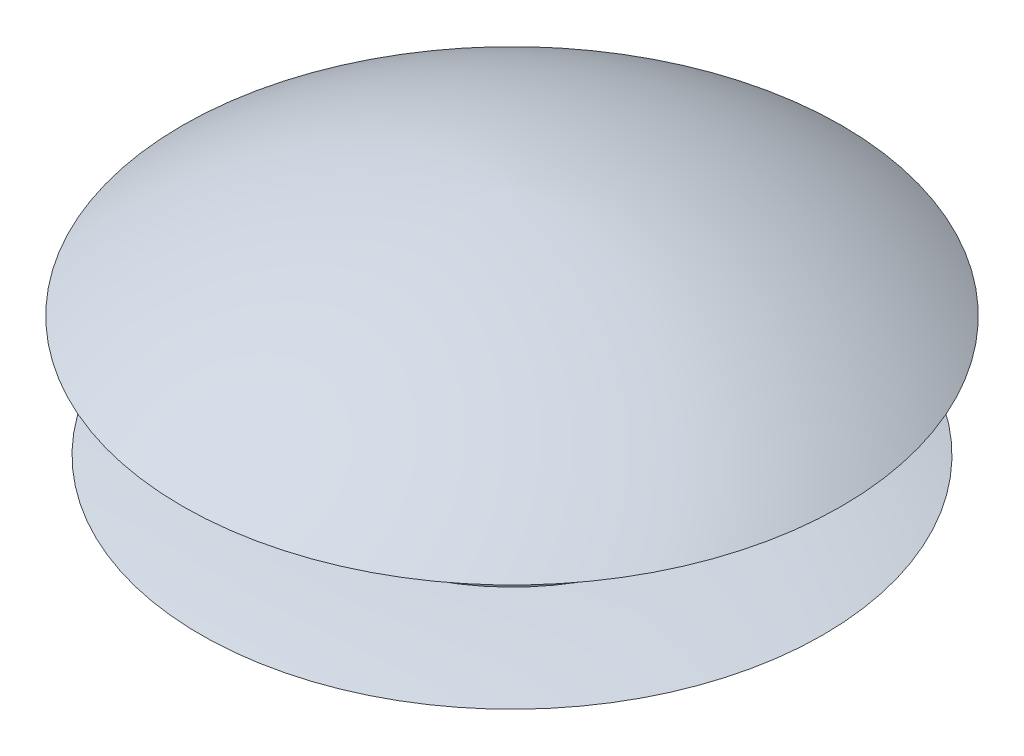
ISO-10303-21;
HEADER;
FILE_DESCRIPTION(('STEP AP214'),'2;1');
FILE_NAME('part.step','',(''),(''),'','','');
FILE_SCHEMA(('AUTOMOTIVE_DESIGN { 1 0 10303 214 1 1 1 1 }'));
ENDSEC;
DATA;
#1=APPLICATION_CONTEXT('core data for automotive mechanical design processes');
#2=APPLICATION_PROTOCOL_DEFINITION('international standard','automotive_design',2000,#1);
#3=PRODUCT_CONTEXT('',#1,'mechanical');
#4=PRODUCT('Part','Part','',(#3));
#5=PRODUCT_RELATED_PRODUCT_CATEGORY('part','',(#4));
#6=PRODUCT_DEFINITION_FORMATION('','',#4);
#7=PRODUCT_DEFINITION_CONTEXT('part definition',#1,'design');
#8=PRODUCT_DEFINITION('design','',#6,#7);
#9=PRODUCT_DEFINITION_SHAPE('','',#8);
#10=(LENGTH_UNIT() NAMED_UNIT(*) SI_UNIT(.MILLI.,.METRE.));
#11=(NAMED_UNIT(*) PLANE_ANGLE_UNIT() SI_UNIT($,.RADIAN.));
#12=(NAMED_UNIT(*) SI_UNIT($,.STERADIAN.) SOLID_ANGLE_UNIT());
#13=UNCERTAINTY_MEASURE_WITH_UNIT(LENGTH_MEASURE(1.E-05),#10,'distance_accuracy_value','');
#14=(GEOMETRIC_REPRESENTATION_CONTEXT(3) GLOBAL_UNCERTAINTY_ASSIGNED_CONTEXT((#13)) GLOBAL_UNIT_ASSIGNED_CONTEXT((#10,
#11,#12)) REPRESENTATION_CONTEXT('',''));
#15=CARTESIAN_POINT('',(0.,0.,0.));
#16=DIRECTION('',(0.,0.,1.));
#17=DIRECTION('',(1.,0.,0.));
#18=AXIS2_PLACEMENT_3D('',#15,#16,#17);
#19=CARTESIAN_POINT('',(0.,-16.4793605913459,0.625945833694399));
#20=DIRECTION('',(-1.,0.,0.));
#21=DIRECTION('',(0.,0.,-1.));
#22=AXIS2_PLACEMENT_3D('',#19,#20,#21);
#23=CIRCLE('',#22,15.3518062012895);
#24=TRIMMED_CURVE('',#23,(PARAMETER_VALUE(-1.53001158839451)),
(PARAMETER_VALUE(1.53001158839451)),.T.,.PARAMETER.);
#25=CARTESIAN_POINT('',(0.,-16.4793605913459,0.));
#26=DIRECTION('',(0.,-1.,0.));
#27=AXIS1_PLACEMENT('',#25,#26);
#28=SURFACE_OF_REVOLUTION('',#24,#27);
#29=CARTESIAN_POINT('',(0.,-1.14032067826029,0.));
#30=VERTEX_POINT('',#29);
#31=VERTEX_LOOP('',#30);
#32=FACE_BOUND('',#31,.T.);
#33=CARTESIAN_POINT('',(0.,-1.84110322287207,0.));
#34=DIRECTION('',(0.,-1.,0.));
#35=DIRECTION('',(1.,0.,0.));
#36=AXIS2_PLACEMENT_3D('',#33,#34,#35);
#37=CIRCLE('',#36,4.);
#38=CARTESIAN_POINT('',(4.,-1.84110322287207,0.));
#39=VERTEX_POINT('',#38);
#40=EDGE_CURVE('E35',#39,#39,#37,.T.);
#41=ORIENTED_EDGE('',*,*,#40,.T.);
#42=EDGE_LOOP('',(#41));
#43=FACE_BOUND('',#42,.T.);
#44=ADVANCED_FACE('F15',(#32,#43),#28,.F.);
#45=CARTESIAN_POINT('',(0.,-4.42055161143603,0.));
#46=DIRECTION('',(0.,-1.,0.));
#47=DIRECTION('',(1.,0.,0.));
#48=AXIS2_PLACEMENT_3D('',#45,#46,#47);
#49=CYLINDRICAL_SURFACE('',#48,4.);
#50=CARTESIAN_POINT('',(0.,-7.,0.));
#51=DIRECTION('',(0.,1.,0.));
#52=DIRECTION('',(-1.,0.,0.));
#53=AXIS2_PLACEMENT_3D('',#50,#51,#52);
#54=CIRCLE('',#53,4.);
#55=CARTESIAN_POINT('',(-3.99999999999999,-7.,0.));
#56=VERTEX_POINT('',#55);
#57=EDGE_CURVE('E37',#56,#56,#54,.T.);
#58=ORIENTED_EDGE('',*,*,#57,.F.);
#59=EDGE_LOOP('',(#58));
#60=FACE_BOUND('',#59,.T.);
#61=ORIENTED_EDGE('',*,*,#40,.F.);
#62=EDGE_LOOP('',(#61));
#63=FACE_BOUND('',#62,.T.);
#64=ADVANCED_FACE('F31',(#60,#63),#49,.F.);
#65=CARTESIAN_POINT('',(0.,14.4090487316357,0.));
#66=DIRECTION('',(0.,1.,0.));
#67=DIRECTION('',(-1.,0.,0.));
#68=AXIS2_PLACEMENT_3D('',#65,#66,#67);
#69=DEGENERATE_TOROIDAL_SURFACE('',#68,2.58166307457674,21.4559792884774,.T.);
#70=CARTESIAN_POINT('',(0.,-6.25000000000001,0.));
#71=DIRECTION('',(0.,1.,0.));
#72=DIRECTION('',(-1.,0.,0.));
#73=AXIS2_PLACEMENT_3D('',#70,#71,#72);
#74=CIRCLE('',#73,8.37500000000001);
#75=CARTESIAN_POINT('',(-8.37500000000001,-6.25000000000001,0.));
#76=VERTEX_POINT('',#75);
#77=EDGE_CURVE('E40',#76,#76,#74,.T.);
#78=ORIENTED_EDGE('',*,*,#77,.F.);
#79=EDGE_LOOP('',(#78));
#80=FACE_BOUND('',#79,.T.);
#81=ORIENTED_EDGE('',*,*,#57,.T.);
#82=EDGE_LOOP('',(#81));
#83=FACE_BOUND('',#82,.T.);
#84=ADVANCED_FACE('F73',(#80,#83),#69,.T.);
#85=CARTESIAN_POINT('',(0.,-28.694631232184,0.));
#86=DIRECTION('',(0.,1.,0.));
#87=DIRECTION('',(-1.,0.,0.));
#88=AXIS2_PLACEMENT_3D('',#85,#86,#87);
#89=DEGENERATE_TOROIDAL_SURFACE('',#88,3.59382785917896,22.9482260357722,.T.);
#90=CARTESIAN_POINT('',(0.,-5.78952791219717,0.));
#91=DIRECTION('',(0.,-1.,0.));
#92=DIRECTION('',(1.,0.,0.));
#93=AXIS2_PLACEMENT_3D('',#90,#91,#92);
#94=CIRCLE('',#93,5.);
#95=CARTESIAN_POINT('',(5.,-5.78952791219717,0.));
#96=VERTEX_POINT('',#95);
#97=EDGE_CURVE('E51',#96,#96,#94,.F.);
#98=ORIENTED_EDGE('',*,*,#97,.F.);
#99=EDGE_LOOP('',(#98));
#100=FACE_BOUND('',#99,.T.);
#101=ORIENTED_EDGE('',*,*,#77,.T.);
#102=EDGE_LOOP('',(#101));
#103=FACE_BOUND('',#102,.T.);
#104=ADVANCED_FACE('F65',(#100,#103),#89,.T.);
#105=CARTESIAN_POINT('',(0.,-4.39476395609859,0.));
#106=DIRECTION('',(0.,-1.,0.));
#107=DIRECTION('',(1.,0.,0.));
#108=AXIS2_PLACEMENT_3D('',#105,#106,#107);
#109=CYLINDRICAL_SURFACE('',#108,5.);
#110=CARTESIAN_POINT('',(0.,-3.,0.));
#111=DIRECTION('',(0.,-1.,0.));
#112=DIRECTION('',(1.,0.,0.));
#113=AXIS2_PLACEMENT_3D('',#110,#111,#112);
#114=CIRCLE('',#113,5.);
#115=CARTESIAN_POINT('',(5.,-3.,0.));
#116=VERTEX_POINT('',#115);
#117=EDGE_CURVE('E19',#116,#116,#114,.F.);
#118=ORIENTED_EDGE('',*,*,#117,.F.);
#119=EDGE_LOOP('',(#118));
#120=FACE_BOUND('',#119,.T.);
#121=ORIENTED_EDGE('',*,*,#97,.T.);
#122=EDGE_LOOP('',(#121));
#123=FACE_BOUND('',#122,.T.);
#124=ADVANCED_FACE('F63',(#120,#123),#109,.T.);
#125=CARTESIAN_POINT('',(6.9375,-3.,0.));
#126=DIRECTION('',(0.,-1.,0.));
#127=DIRECTION('',(0.,0.,-1.));
#128=AXIS2_PLACEMENT_3D('',#125,#126,#127);
#129=PLANE('',#128);
#130=ORIENTED_EDGE('',*,*,#117,.T.);
#131=EDGE_LOOP('',(#130));
#132=FACE_BOUND('',#131,.T.);
#133=CARTESIAN_POINT('',(0.,-3.,0.));
#134=DIRECTION('',(0.,1.,0.));
#135=DIRECTION('',(-1.,0.,0.));
#136=AXIS2_PLACEMENT_3D('',#133,#134,#135);
#137=CIRCLE('',#136,8.875);
#138=CARTESIAN_POINT('',(-8.875,-3.,0.));
#139=VERTEX_POINT('',#138);
#140=EDGE_CURVE('E10',#139,#139,#137,.T.);
#141=ORIENTED_EDGE('',*,*,#140,.F.);
#142=EDGE_LOOP('',(#141));
#143=FACE_BOUND('',#142,.T.);
#144=ADVANCED_FACE('F60',(#132,#143),#129,.T.);
#145=CARTESIAN_POINT('',(0.625945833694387,-16.4793605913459,0.));
#146=DIRECTION('',(0.,0.,-1.));
#147=DIRECTION('',(-1.,0.,0.));
#148=AXIS2_PLACEMENT_3D('',#145,#146,#147);
#149=CIRCLE('',#148,16.4912441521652);
#150=TRIMMED_CURVE('',#149,(PARAMETER_VALUE(-1.53283095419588)),
(PARAMETER_VALUE(1.53283095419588)),.T.,.PARAMETER.);
#151=CARTESIAN_POINT('',(0.,-16.4793605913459,0.));
#152=DIRECTION('',(0.,1.,0.));
#153=AXIS1_PLACEMENT('',#151,#152);
#154=SURFACE_OF_REVOLUTION('',#150,#153);
#155=CARTESIAN_POINT('',(0.,0.,0.));
#156=VERTEX_POINT('',#155);
#157=VERTEX_LOOP('',#156);
#158=FACE_BOUND('',#157,.T.);
#159=ORIENTED_EDGE('',*,*,#140,.T.);
#160=EDGE_LOOP('',(#159));
#161=FACE_BOUND('',#160,.T.);
#162=ADVANCED_FACE('F17',(#158,#161),#154,.T.);
#163=CLOSED_SHELL('',(#44,#64,#84,#104,#124,#144,#162));
#164=MANIFOLD_SOLID_BREP('B1',#163);
#165=ADVANCED_BREP_SHAPE_REPRESENTATION('',(#18,#164),#14);
#166=SHAPE_DEFINITION_REPRESENTATION(#9,#165);
ENDSEC;
END-ISO-10303-21;
